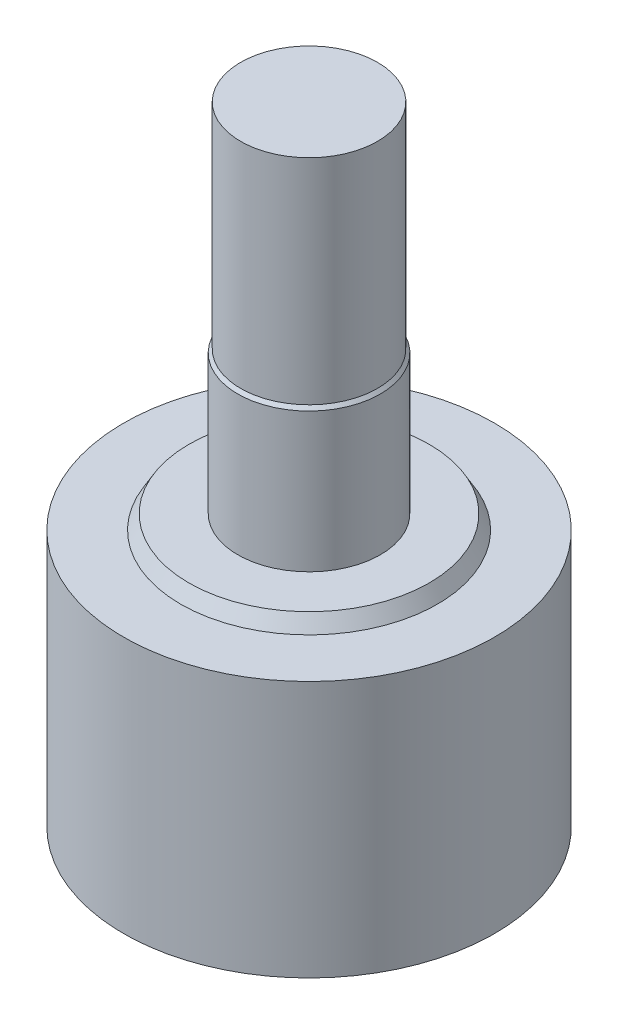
ISO-10303-21;
HEADER;
FILE_DESCRIPTION(('STEP AP214'),'2;1');
FILE_NAME('part.step','',(''),(''),'','','');
FILE_SCHEMA(('AUTOMOTIVE_DESIGN { 1 0 10303 214 1 1 1 1 }'));
ENDSEC;
DATA;
#1=APPLICATION_CONTEXT('core data for automotive mechanical design processes');
#2=APPLICATION_PROTOCOL_DEFINITION('international standard','automotive_design',2000,#1);
#3=PRODUCT_CONTEXT('',#1,'mechanical');
#4=PRODUCT('Part','Part','',(#3));
#5=PRODUCT_RELATED_PRODUCT_CATEGORY('part','',(#4));
#6=PRODUCT_DEFINITION_FORMATION('','',#4);
#7=PRODUCT_DEFINITION_CONTEXT('part definition',#1,'design');
#8=PRODUCT_DEFINITION('design','',#6,#7);
#9=PRODUCT_DEFINITION_SHAPE('','',#8);
#10=(LENGTH_UNIT() NAMED_UNIT(*) SI_UNIT(.MILLI.,.METRE.));
#11=(NAMED_UNIT(*) PLANE_ANGLE_UNIT() SI_UNIT($,.RADIAN.));
#12=(NAMED_UNIT(*) SI_UNIT($,.STERADIAN.) SOLID_ANGLE_UNIT());
#13=UNCERTAINTY_MEASURE_WITH_UNIT(LENGTH_MEASURE(1.E-05),#10,'distance_accuracy_value','');
#14=(GEOMETRIC_REPRESENTATION_CONTEXT(3) GLOBAL_UNCERTAINTY_ASSIGNED_CONTEXT((#13)) GLOBAL_UNIT_ASSIGNED_CONTEXT((#10,
#11,#12)) REPRESENTATION_CONTEXT('',''));
#15=CARTESIAN_POINT('',(0.,0.,0.));
#16=DIRECTION('',(0.,0.,1.));
#17=DIRECTION('',(1.,0.,0.));
#18=AXIS2_PLACEMENT_3D('',#15,#16,#17);
#19=CARTESIAN_POINT('',(0.,0.,0.));
#20=DIRECTION('',(0.,1.,0.));
#21=DIRECTION('',(0.,0.,1.));
#22=AXIS2_PLACEMENT_3D('',#19,#20,#21);
#23=CONICAL_SURFACE('',#22,4.21132486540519,0.523598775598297);
#24=CARTESIAN_POINT('',(0.,0.5,0.));
#25=DIRECTION('',(0.,-1.,0.));
#26=DIRECTION('',(0.,0.,-1.));
#27=AXIS2_PLACEMENT_3D('',#24,#25,#26);
#28=CIRCLE('',#27,4.5);
#29=CARTESIAN_POINT('',(0.,0.5,-4.5));
#30=VERTEX_POINT('',#29);
#31=EDGE_CURVE('E10',#30,#30,#28,.T.);
#32=ORIENTED_EDGE('',*,*,#31,.T.);
#33=EDGE_LOOP('',(#32));
#34=FACE_BOUND('',#33,.T.);
#35=CARTESIAN_POINT('',(0.,0.,0.));
#36=DIRECTION('',(0.,-1.,0.));
#37=DIRECTION('',(0.,0.,-1.));
#38=AXIS2_PLACEMENT_3D('',#35,#36,#37);
#39=CIRCLE('',#38,4.21132486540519);
#40=CARTESIAN_POINT('',(0.,0.,-4.21132486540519));
#41=VERTEX_POINT('',#40);
#42=EDGE_CURVE('E62',#41,#41,#39,.T.);
#43=ORIENTED_EDGE('',*,*,#42,.F.);
#44=EDGE_LOOP('',(#43));
#45=FACE_BOUND('',#44,.T.);
#46=ADVANCED_FACE('F28',(#34,#45),#23,.T.);
#47=CARTESIAN_POINT('',(4.5,0.5,0.));
#48=DIRECTION('',(0.,-1.,0.));
#49=DIRECTION('',(0.,0.,-1.));
#50=AXIS2_PLACEMENT_3D('',#47,#48,#49);
#51=PLANE('',#50);
#52=CARTESIAN_POINT('',(0.,0.5,0.));
#53=DIRECTION('',(0.,-1.,0.));
#54=DIRECTION('',(0.,0.,-1.));
#55=AXIS2_PLACEMENT_3D('',#52,#53,#54);
#56=CIRCLE('',#55,6.5);
#57=CARTESIAN_POINT('',(0.,0.5,-6.5));
#58=VERTEX_POINT('',#57);
#59=EDGE_CURVE('E34',#58,#58,#56,.T.);
#60=ORIENTED_EDGE('',*,*,#59,.T.);
#61=EDGE_LOOP('',(#60));
#62=FACE_BOUND('',#61,.T.);
#63=ORIENTED_EDGE('',*,*,#31,.F.);
#64=EDGE_LOOP('',(#63));
#65=FACE_BOUND('',#64,.T.);
#66=ADVANCED_FACE('F69',(#62,#65),#51,.T.);
#67=CARTESIAN_POINT('',(0.,0.,0.));
#68=DIRECTION('',(0.,-1.,0.));
#69=DIRECTION('',(0.,0.,-1.));
#70=AXIS2_PLACEMENT_3D('',#67,#68,#69);
#71=CYLINDRICAL_SURFACE('',#70,6.5);
#72=CARTESIAN_POINT('',(0.,9.5,0.));
#73=DIRECTION('',(0.,-1.,0.));
#74=DIRECTION('',(0.,0.,-1.));
#75=AXIS2_PLACEMENT_3D('',#72,#73,#74);
#76=CIRCLE('',#75,6.5);
#77=CARTESIAN_POINT('',(0.,9.5,-6.5));
#78=VERTEX_POINT('',#77);
#79=EDGE_CURVE('E38',#78,#78,#76,.T.);
#80=ORIENTED_EDGE('',*,*,#79,.T.);
#81=EDGE_LOOP('',(#80));
#82=FACE_BOUND('',#81,.T.);
#83=ORIENTED_EDGE('',*,*,#59,.F.);
#84=EDGE_LOOP('',(#83));
#85=FACE_BOUND('',#84,.T.);
#86=ADVANCED_FACE('F73',(#82,#85),#71,.T.);
#87=CARTESIAN_POINT('',(6.5,9.5,0.));
#88=DIRECTION('',(0.,1.,0.));
#89=DIRECTION('',(0.,0.,1.));
#90=AXIS2_PLACEMENT_3D('',#87,#88,#89);
#91=PLANE('',#90);
#92=CARTESIAN_POINT('',(0.,9.5,0.));
#93=DIRECTION('',(0.,-1.,0.));
#94=DIRECTION('',(0.,0.,-1.));
#95=AXIS2_PLACEMENT_3D('',#92,#93,#94);
#96=CIRCLE('',#95,4.5);
#97=CARTESIAN_POINT('',(0.,9.5,-4.5));
#98=VERTEX_POINT('',#97);
#99=EDGE_CURVE('E42',#98,#98,#96,.T.);
#100=ORIENTED_EDGE('',*,*,#99,.T.);
#101=EDGE_LOOP('',(#100));
#102=FACE_BOUND('',#101,.T.);
#103=ORIENTED_EDGE('',*,*,#79,.F.);
#104=EDGE_LOOP('',(#103));
#105=FACE_BOUND('',#104,.T.);
#106=ADVANCED_FACE('F77',(#102,#105),#91,.T.);
#107=CARTESIAN_POINT('',(0.,9.5,0.));
#108=DIRECTION('',(0.,-1.,0.));
#109=DIRECTION('',(0.,0.,-1.));
#110=AXIS2_PLACEMENT_3D('',#107,#108,#109);
#111=CONICAL_SURFACE('',#110,4.5,0.523598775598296);
#112=CARTESIAN_POINT('',(0.,10.,0.));
#113=DIRECTION('',(0.,-1.,0.));
#114=DIRECTION('',(0.,0.,-1.));
#115=AXIS2_PLACEMENT_3D('',#112,#113,#114);
#116=CIRCLE('',#115,4.21132486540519);
#117=CARTESIAN_POINT('',(0.,10.,-4.21132486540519));
#118=VERTEX_POINT('',#117);
#119=EDGE_CURVE('E47',#118,#118,#116,.T.);
#120=ORIENTED_EDGE('',*,*,#119,.T.);
#121=EDGE_LOOP('',(#120));
#122=FACE_BOUND('',#121,.T.);
#123=ORIENTED_EDGE('',*,*,#99,.F.);
#124=EDGE_LOOP('',(#123));
#125=FACE_BOUND('',#124,.T.);
#126=ADVANCED_FACE('F84',(#122,#125),#111,.T.);
#127=CARTESIAN_POINT('',(4.21132486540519,10.,0.));
#128=DIRECTION('',(0.,1.,0.));
#129=DIRECTION('',(0.,0.,1.));
#130=AXIS2_PLACEMENT_3D('',#127,#128,#129);
#131=PLANE('',#130);
#132=CARTESIAN_POINT('',(0.,10.,0.));
#133=DIRECTION('',(0.,-1.,0.));
#134=DIRECTION('',(0.,0.,-1.));
#135=AXIS2_PLACEMENT_3D('',#132,#133,#134);
#136=CIRCLE('',#135,2.5);
#137=CARTESIAN_POINT('',(0.,10.,-2.5));
#138=VERTEX_POINT('',#137);
#139=EDGE_CURVE('E50',#138,#138,#136,.T.);
#140=ORIENTED_EDGE('',*,*,#139,.T.);
#141=EDGE_LOOP('',(#140));
#142=FACE_BOUND('',#141,.T.);
#143=ORIENTED_EDGE('',*,*,#119,.F.);
#144=EDGE_LOOP('',(#143));
#145=FACE_BOUND('',#144,.T.);
#146=ADVANCED_FACE('F88',(#142,#145),#131,.T.);
#147=CARTESIAN_POINT('',(0.,0.,0.));
#148=DIRECTION('',(0.,-1.,0.));
#149=DIRECTION('',(0.,0.,-1.));
#150=AXIS2_PLACEMENT_3D('',#147,#148,#149);
#151=CYLINDRICAL_SURFACE('',#150,2.5);
#152=CARTESIAN_POINT('',(0.,14.8808246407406,0.));
#153=DIRECTION('',(0.,-1.,0.));
#154=DIRECTION('',(0.,0.,-1.));
#155=AXIS2_PLACEMENT_3D('',#152,#153,#154);
#156=CIRCLE('',#155,2.5);
#157=CARTESIAN_POINT('',(0.,14.8808246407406,-2.5));
#158=VERTEX_POINT('',#157);
#159=EDGE_CURVE('E53',#158,#158,#156,.T.);
#160=ORIENTED_EDGE('',*,*,#159,.T.);
#161=EDGE_LOOP('',(#160));
#162=FACE_BOUND('',#161,.T.);
#163=ORIENTED_EDGE('',*,*,#139,.F.);
#164=EDGE_LOOP('',(#163));
#165=FACE_BOUND('',#164,.T.);
#166=ADVANCED_FACE('F92',(#162,#165),#151,.T.);
#167=CARTESIAN_POINT('',(0.,14.8808246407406,0.));
#168=DIRECTION('',(0.,-1.,0.));
#169=DIRECTION('',(0.,0.,-1.));
#170=AXIS2_PLACEMENT_3D('',#167,#168,#169);
#171=CONICAL_SURFACE('',#170,2.5,0.698131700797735);
#172=CARTESIAN_POINT('',(0.,15.,0.));
#173=DIRECTION('',(0.,-1.,0.));
#174=DIRECTION('',(0.,0.,-1.));
#175=AXIS2_PLACEMENT_3D('',#172,#173,#174);
#176=CIRCLE('',#175,2.4);
#177=CARTESIAN_POINT('',(0.,15.,-2.4));
#178=VERTEX_POINT('',#177);
#179=EDGE_CURVE('E56',#178,#178,#176,.T.);
#180=ORIENTED_EDGE('',*,*,#179,.T.);
#181=EDGE_LOOP('',(#180));
#182=FACE_BOUND('',#181,.T.);
#183=ORIENTED_EDGE('',*,*,#159,.F.);
#184=EDGE_LOOP('',(#183));
#185=FACE_BOUND('',#184,.T.);
#186=ADVANCED_FACE('F96',(#182,#185),#171,.T.);
#187=CARTESIAN_POINT('',(0.,0.,0.));
#188=DIRECTION('',(0.,-1.,0.));
#189=DIRECTION('',(0.,0.,-1.));
#190=AXIS2_PLACEMENT_3D('',#187,#188,#189);
#191=CYLINDRICAL_SURFACE('',#190,2.4);
#192=CARTESIAN_POINT('',(0.,22.5,0.));
#193=DIRECTION('',(0.,-1.,0.));
#194=DIRECTION('',(0.,0.,-1.));
#195=AXIS2_PLACEMENT_3D('',#192,#193,#194);
#196=CIRCLE('',#195,2.4);
#197=CARTESIAN_POINT('',(0.,22.5,-2.4));
#198=VERTEX_POINT('',#197);
#199=EDGE_CURVE('E59',#198,#198,#196,.T.);
#200=ORIENTED_EDGE('',*,*,#199,.T.);
#201=EDGE_LOOP('',(#200));
#202=FACE_BOUND('',#201,.T.);
#203=ORIENTED_EDGE('',*,*,#179,.F.);
#204=EDGE_LOOP('',(#203));
#205=FACE_BOUND('',#204,.T.);
#206=ADVANCED_FACE('F100',(#202,#205),#191,.T.);
#207=CARTESIAN_POINT('',(2.4,22.5,0.));
#208=DIRECTION('',(0.,1.,0.));
#209=DIRECTION('',(0.,0.,1.));
#210=AXIS2_PLACEMENT_3D('',#207,#208,#209);
#211=PLANE('',#210);
#212=ORIENTED_EDGE('',*,*,#199,.F.);
#213=EDGE_LOOP('',(#212));
#214=FACE_BOUND('',#213,.T.);
#215=ADVANCED_FACE('F104',(#214),#211,.T.);
#216=CARTESIAN_POINT('',(0.,0.,0.));
#217=DIRECTION('',(0.,-1.,0.));
#218=DIRECTION('',(0.,0.,-1.));
#219=AXIS2_PLACEMENT_3D('',#216,#217,#218);
#220=PLANE('',#219);
#221=ORIENTED_EDGE('',*,*,#42,.T.);
#222=EDGE_LOOP('',(#221));
#223=FACE_BOUND('',#222,.T.);
#224=ADVANCED_FACE('F66',(#223),#220,.T.);
#225=CLOSED_SHELL('',(#46,#66,#86,#106,#126,#146,#166,#186,#206,#215,#224));
#226=MANIFOLD_SOLID_BREP('B2',#225);
#227=ADVANCED_BREP_SHAPE_REPRESENTATION('',(#18,#226),#14);
#228=SHAPE_DEFINITION_REPRESENTATION(#9,#227);
ENDSEC;
END-ISO-10303-21;
